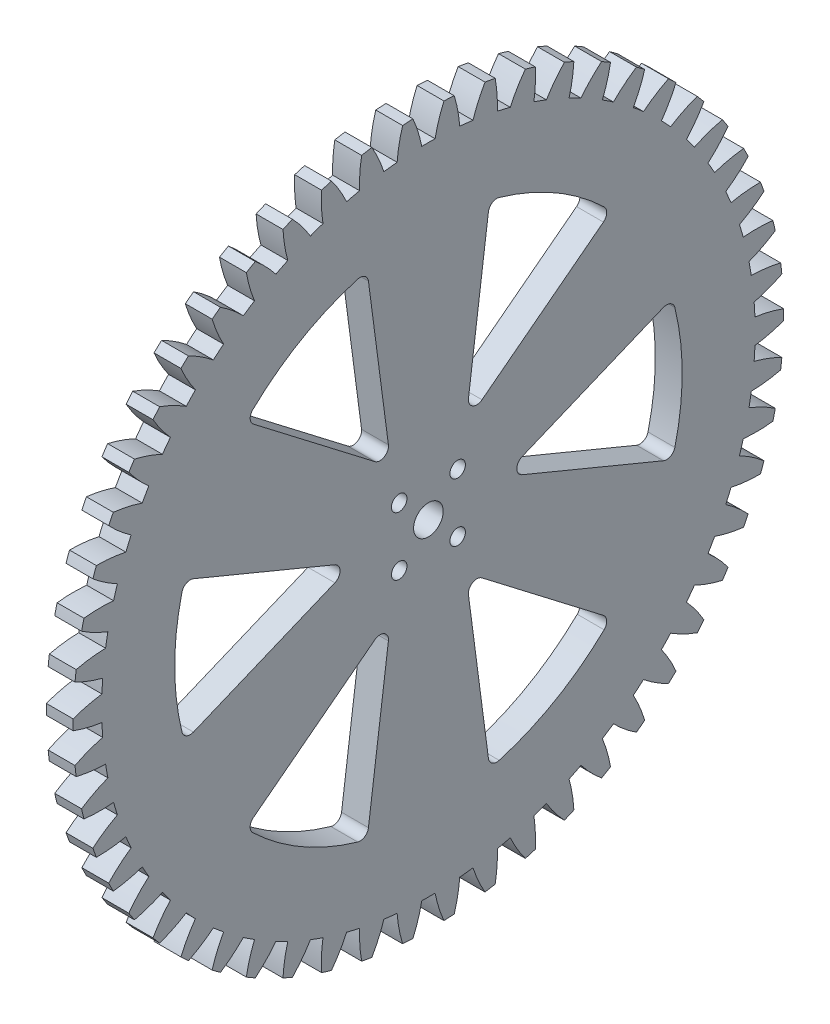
from build123d import *

# Parameters (mm, degrees)
BASPROSKE_W                        = 6.35
BASPROSKE_H                        = 84
TOOTHCUT_DEPTH                     = 119.963534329
TEETHCUTS_COUNT                    = 54
TEETHCUTS_ANGLE                    = 353.333333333
BORSKE_R                           = 3.5
BORE_DEPTH                         = 50.0000508
ENL_V_MAT_EXTRU_1_REACH            = 120.907
ESQUISSE1_R                        = 1.83
R_P_TITION_CIRCULAIRE1_COUNT       = 4
ENL_V_MAT_EXTRU_2_REACH            = 120.907
CONG_1_R                           = 2
R_P_TITION_CIRCULAIRE2_COUNT       = 6
CONG_1_OF_R_P_TITION_CIRCULAIRE2_R = 2


with BuildPart() as part:
    # BasProSke → Base-Revolve (revolve)
    with BuildSketch(Plane(origin=(0, 0, 0), x_dir=(1, 0, 0), z_dir=(0, 1, 0)), mode=Mode.PRIVATE) as base_revolve_sk:
        with Locations((3.175, 42)):
            Rectangle(BASPROSKE_W, BASPROSKE_H)
    revolve(base_revolve_sk.sketch.rotate(Axis((-10, 0, 0), (1, 0, 0)), 180), axis=Axis((-10, 0, 0), (1, 0, 0)))

    # TooCutSke → ToothCut (cut, through all)
    with BuildSketch(Plane(origin=(0, 0, 0), x_dir=(0, 0, -1), z_dir=(1, 0, 0))):
        with BuildLine():
            ThreePointArc((1.575386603, 77.232934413), (0, 77.249), (-1.575386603, 77.232934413))
            ThreePointArc((-1.575386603, 77.232934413), (-2.443081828, 80.646109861), (-3.676100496, 83.944947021))
            ThreePointArc((-3.676100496, 83.944947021), (0, 84.0254), (3.676100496, 83.944947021))
            ThreePointArc((3.676100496, 83.944947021), (2.443081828, 80.646109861), (1.575386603, 77.232934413))
        make_face()
    toothcut = extrude(amount=TOOTHCUT_DEPTH, mode=Mode.SUBTRACT)

    # TeethCuts: ToothCut ×54 about axis
    teethcuts_axis = Axis((-10, 0, 0), (1, 0, 0))
    for i in range(1, TEETHCUTS_COUNT):
        add(toothcut.rotate(teethcuts_axis, i * TEETHCUTS_ANGLE / (TEETHCUTS_COUNT - 1)), mode=Mode.SUBTRACT)

    # BorSke → Bore (cut, symmetric)
    with BuildSketch(Plane(origin=(0, 0, 0), x_dir=(0, 0, -1), z_dir=(1, 0, 0))):
        with Locations(Location((0, 0, 0), (0, 0, 180))):
            Circle(BORSKE_R)
    extrude(amount=BORE_DEPTH, both=True, mode=Mode.SUBTRACT)

    # Esquisse1 → Enl_v. mat.-Extru.1 (cut, up to next)
    with BuildSketch(Plane.ZY, mode=Mode.PRIVATE) as enl_v_mat_extru_1_sk1:
        with Locations((6.914797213, 6.914797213)):
            Circle(ESQUISSE1_R)
    enl_v_mat_extru_1_tool1 = extrude(enl_v_mat_extru_1_sk1.sketch, amount=-ENL_V_MAT_EXTRU_1_REACH, mode=Mode.PRIVATE) & part.part
    enl_v_mat_extru_1 = enl_v_mat_extru_1_tool1.solids().sort_by_distance((0, 6.914797, 6.914797))[0]
    add(enl_v_mat_extru_1, mode=Mode.SUBTRACT)

    # R_p_tition circulaire1: Enl_v. mat.-Extru.1 ×4 about axis
    r_p_tition_circulaire1_axis = Axis((0, 0, 0), (1, 0, 0))
    for i in range(1, R_P_TITION_CIRCULAIRE1_COUNT):
        add(enl_v_mat_extru_1.rotate(r_p_tition_circulaire1_axis, i * 360 / R_P_TITION_CIRCULAIRE1_COUNT), mode=Mode.SUBTRACT)

    # Esquisse2 → Enl_v. mat.-Extru.2 (cut, up to next)
    with BuildSketch(Plane.ZY, mode=Mode.PRIVATE) as enl_v_mat_extru_2_sk1:
        with BuildLine():
            Line((17.667004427, 0), (57.667004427, 16.568542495))
            ThreePointArc((57.667004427, 16.568542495), (60, 0), (57.667004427, -16.568542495))
            Line((57.667004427, -16.568542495), (17.667004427, 0))
        make_face()
    enl_v_mat_extru_2_tool1 = extrude(enl_v_mat_extru_2_sk1.sketch, amount=-ENL_V_MAT_EXTRU_2_REACH, mode=Mode.PRIVATE) & part.part
    enl_v_mat_extru_2 = enl_v_mat_extru_2_tool1.solids().sort_by_distance((0, 0, 45.366966))[0]
    add(enl_v_mat_extru_2, mode=Mode.SUBTRACT)

    # Cong_1
    cong_1_edges = [part.edges().sort_by_distance(p)[0] for p in [
        (3.175, -16.568542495, 57.667004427),
        (3.175, 0, 17.667004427),
        (3.175, 16.568542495, 57.667004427),
    ]]
    fillet(cong_1_edges, radius=CONG_1_R)

    # R_p_tition circulaire2: Enl_v. mat.-Extru.2 ×6 about axis
    r_p_tition_circulaire2_axis = Axis((0, 0, 0), (1, 0, 0))
    for i in range(1, R_P_TITION_CIRCULAIRE2_COUNT):
        add(enl_v_mat_extru_2.rotate(r_p_tition_circulaire2_axis, i * 360 / R_P_TITION_CIRCULAIRE2_COUNT), mode=Mode.SUBTRACT)

    # Cong_1 of R_p_tition circulaire2
    cong_1_of_r_p_tition_circulaire2_edges = [part.edges().sort_by_distance(p)[0] for p in [
        (3.175, -58.225362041, 14.484723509),
        (3.175, -15.300074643, 8.833502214),
        (3.175, -41.656819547, 43.182280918),
        (3.175, -41.656819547, -43.182280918),
        (3.175, -15.300074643, -8.833502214),
        (3.175, -58.225362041, -14.484723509),
        (3.175, 16.568542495, -57.667004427),
        (3.175, 0, -17.667004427),
        (3.175, -16.568542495, -57.667004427),
        (3.175, 58.225362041, -14.484723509),
        (3.175, 15.300074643, -8.833502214),
        (3.175, 41.656819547, -43.182280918),
        (3.175, 41.656819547, 43.182280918),
        (3.175, 15.300074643, 8.833502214),
        (3.175, 58.225362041, 14.484723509),
    ]]
    fillet(cong_1_of_r_p_tition_circulaire2_edges, radius=CONG_1_OF_R_P_TITION_CIRCULAIRE2_R)


solid = part.part
